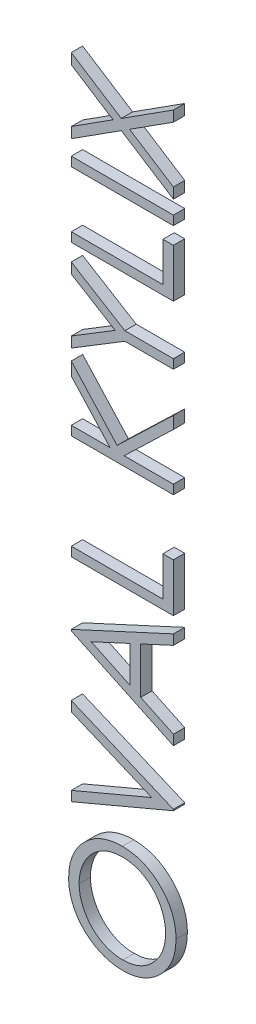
from build123d import *

# Parameters (mm, degrees)
ESTRUSIONE_ESTRUSIONE1_DEPTH   = 10
ESTRUSIONE_ESTRUSIONE1_2_DEPTH = 10
ESTRUSIONE_ESTRUSIONE1_3_DEPTH = 10
ESTRUSIONE_ESTRUSIONE1_4_DEPTH = 10
ESTRUSIONE_ESTRUSIONE1_5_DEPTH = 10
ESTRUSIONE_ESTRUSIONE1_6_DEPTH = 10
ESTRUSIONE_ESTRUSIONE1_7_DEPTH = 10
SCHIZZO2_W                     = 90
SCHIZZO2_H                     = 8.076923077
ESTRUSIONE_ESTRUSIONE1_8_DEPTH = 10
ESTRUSIONE_ESTRUSIONE1_9_DEPTH = 10


with BuildPart() as part:
    # Schizzo2 → Estrusione-Estrusione1 (new body)
    with BuildSketch(Plane.XY):
        with BuildLine():
            add(Edge.make_bspline(
                [(102.692307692, 53.653846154), (102.733806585, 55.320522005), (102.815313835, 58.594010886), (103.459836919, 63.400564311), (104.520654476, 68.003054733), (106.018755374, 72.404128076), (107.960854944, 76.587045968), (110.319949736, 80.563622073), (113.110376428, 84.32193899), (116.291160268, 87.836126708), (119.774637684, 91.04188004), (123.503766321, 93.854945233), (127.431661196, 96.228031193), (131.558527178, 98.170660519), (135.874729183, 99.69575329), (140.404457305, 100.74788327), (145.118043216, 101.420027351), (148.333021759, 101.498601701), (149.963942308, 101.538461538)],
                knots=[0, 0, 0, 0, 1.065064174, 2.09187391, 3.093564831, 4.079973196, 5.057907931, 6.036227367, 7.030399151, 8.044883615, 9.061699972, 10.052012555, 11.025713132, 11.989727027, 12.962874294, 13.945865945, 14.957962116, 16, 16, 16, 16], degree=3))
            add(Edge.make_bspline(
                [(149.963942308, 101.538461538), (151.582839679, 101.498588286), (154.773873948, 101.419993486), (159.457682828, 100.747337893), (163.959573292, 99.691058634), (168.269511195, 98.189543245), (172.387995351, 96.245423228), (176.318863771, 93.86884373), (180.057952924, 91.061117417), (183.565428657, 87.868977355), (186.773956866, 84.378863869), (189.60400372, 80.664067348), (191.978122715, 76.736277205), (193.94243974, 72.636196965), (195.435749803, 68.331631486), (196.522928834, 63.853905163), (197.188400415, 59.178621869), (197.267492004, 55.993777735), (197.307692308, 54.375)],
                knots=[0, 0, 0, 0, 1.043748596, 2.057349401, 3.045489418, 4.02252776, 4.995289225, 5.97782527, 6.980224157, 8.006516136, 9.032559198, 10.034193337, 11.013412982, 11.987833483, 12.961212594, 13.946489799, 14.956251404, 16, 16, 16, 16], degree=3))
            add(Edge.make_bspline(
                [(197.307692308, 54.375), (197.267850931, 52.744088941), (197.189312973, 49.529129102), (196.51607685, 44.809605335), (195.463300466, 40.276749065), (193.958772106, 35.943522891), (192.014329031, 31.807510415), (189.643359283, 27.860622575), (186.830032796, 24.118701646), (183.637178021, 20.612771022), (180.161338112, 17.404934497), (176.437028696, 14.608264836), (172.537316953, 12.236761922), (168.451380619, 10.298847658), (164.198972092, 8.764618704), (159.751725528, 7.71792338), (155.134995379, 7.040713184), (151.991606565, 6.962674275), (150.396634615, 6.923076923)],
                knots=[0, 0, 0, 0, 1.053102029, 2.075944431, 3.073151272, 4.055350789, 5.033113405, 6.020478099, 7.024410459, 8.052272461, 9.079885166, 10.07527673, 11.055994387, 12.023226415, 12.992069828, 13.970394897, 14.97016774, 16, 16, 16, 16], degree=3))
            add(Edge.make_bspline(
                [(150.396634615, 6.923076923), (149.326080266, 6.936824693), (147.19847709, 6.964146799), (144.039050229, 7.293076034), (140.930433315, 7.770376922), (137.881466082, 8.454426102), (134.899612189, 9.349068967), (131.964306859, 10.404692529), (129.10529682, 11.694002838), (126.309038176, 13.151505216), (123.619120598, 14.778237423), (121.076502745, 16.575042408), (118.659848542, 18.478809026), (116.431782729, 20.56586772), (114.327488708, 22.767433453), (112.379304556, 25.119220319), (110.56966296, 27.606878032), (108.938854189, 30.241110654), (107.463905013, 32.957009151), (106.198200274, 35.756697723), (105.111872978, 38.602152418), (104.231394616, 41.506700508), (103.536285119, 44.462628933), (103.062953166, 47.476389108), (102.733184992, 50.545580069), (102.705992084, 52.613299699), (102.692307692, 53.653846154)],
                knots=[0, 0, 0, 0, 1.037015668, 2.060948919, 3.074880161, 4.083647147, 5.086022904, 6.090072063, 7.104153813, 8.122640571, 9.144368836, 10.147691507, 11.138137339, 12.123020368, 13.103399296, 14.087645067, 15.080126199, 16.082011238, 17.087798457, 18.072939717, 19.057185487, 20.037253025, 21.01195951, 21.997135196, 22.992090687, 24, 24, 24, 24], degree=3))
        make_face()
        with BuildLine():
            add(Edge.make_bspline(
                [(111.923076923, 54.050480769), (111.933452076, 53.19637927), (111.954103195, 51.496341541), (112.227615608, 48.969186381), (112.614648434, 46.474500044), (113.176755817, 44.017110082), (113.903817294, 41.591862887), (114.780710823, 39.197681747), (115.840568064, 36.842775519), (117.032506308, 34.530086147), (118.386357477, 32.313029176), (119.824015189, 30.186265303), (121.398896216, 28.205113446), (123.07694135, 26.342358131), (124.872713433, 24.602631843), (126.774419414, 22.98670196), (128.790284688, 21.495893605), (130.912013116, 20.148148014), (133.127758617, 18.948759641), (135.395165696, 17.874896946), (137.740881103, 16.984705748), (140.150266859, 16.279541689), (142.612705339, 15.681018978), (145.141612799, 15.305581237), (147.728271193, 15.029373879), (149.476385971, 15.00986668), (150.360576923, 15)],
                knots=[0, 0, 0, 0, 1.008406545, 2.007172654, 2.999155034, 3.989332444, 4.982025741, 5.988181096, 6.998684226, 8.030553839, 9.059268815, 10.065399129, 11.060956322, 12.046057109, 13.024974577, 14.012068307, 14.991706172, 15.984221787, 16.978487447, 17.966117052, 18.945677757, 19.938371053, 20.93015022, 21.936155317, 22.956113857, 24, 24, 24, 24], degree=3))
            add(Edge.make_bspline(
                [(150.360576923, 15), (151.660718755, 15.032857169), (154.21849995, 15.097497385), (157.967245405, 15.661050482), (161.573456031, 16.536022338), (165.015637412, 17.804566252), (168.309139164, 19.422844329), (171.441144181, 21.396815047), (174.41072855, 23.744555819), (177.195786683, 26.409814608), (179.736807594, 29.324204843), (181.970378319, 32.417375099), (183.85021374, 35.664853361), (185.421713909, 39.047922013), (186.605616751, 42.595465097), (187.44973893, 46.284737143), (187.996838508, 50.115819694), (188.049974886, 52.726480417), (188.076923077, 54.050480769)],
                knots=[0, 0, 0, 0, 1.032022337, 2.030307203, 3.003823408, 3.974715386, 4.937372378, 5.913284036, 6.909147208, 7.938749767, 8.970518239, 9.975863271, 10.963918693, 11.946286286, 12.933361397, 13.927862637, 14.949112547, 16, 16, 16, 16], degree=3))
            add(Edge.make_bspline(
                [(188.076923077, 54.050480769), (188.064705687, 54.940442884), (188.040474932, 56.705505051), (187.79607868, 59.330767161), (187.404944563, 61.90897664), (186.8390103, 64.435369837), (186.140087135, 66.913256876), (185.273144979, 69.335161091), (184.233889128, 71.700278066), (183.075672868, 74.020237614), (181.759970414, 76.24309359), (180.34169365, 78.356956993), (178.794600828, 80.334695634), (177.139092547, 82.19657697), (175.348840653, 83.92411072), (173.45869204, 85.535439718), (171.438548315, 87.00047158), (169.325509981, 88.343648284), (167.125918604, 89.557671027), (164.852277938, 90.600471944), (162.516782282, 91.491045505), (160.117715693, 92.208948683), (157.660474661, 92.771787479), (155.141542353, 93.159537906), (152.566019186, 93.430788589), (150.82403394, 93.451232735), (149.945913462, 93.461538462)],
                knots=[0, 0, 0, 0, 1.047334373, 2.07717862, 3.100662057, 4.115010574, 5.122652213, 6.129548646, 7.140165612, 8.16200981, 9.179904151, 10.178566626, 11.156366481, 12.133321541, 13.108841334, 14.082538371, 15.054589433, 16.043660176, 17.028268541, 18.009491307, 18.985652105, 19.968123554, 20.954864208, 21.950389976, 22.966808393, 24, 24, 24, 24], degree=3))
            add(Edge.make_bspline(
                [(149.945913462, 93.461538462), (149.073800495, 93.451224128), (147.343803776, 93.430763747), (144.786239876, 93.159671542), (142.285443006, 92.771362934), (139.85123094, 92.211750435), (137.482983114, 91.490460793), (135.18292403, 90.6010722), (132.942484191, 89.552307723), (130.767204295, 88.348666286), (128.679846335, 86.995693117), (126.684383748, 85.517250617), (124.818122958, 83.887927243), (123.035621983, 82.153848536), (121.372534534, 80.273323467), (119.835286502, 78.246023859), (118.35461462, 76.122426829), (117.044203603, 73.854508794), (115.827982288, 71.522331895), (114.790358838, 69.127055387), (113.899187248, 66.702887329), (113.174585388, 64.240135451), (112.616801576, 61.739963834), (112.227269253, 59.203826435), (111.954197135, 56.640575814), (111.933483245, 54.916585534), (111.923076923, 54.050480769)],
                knots=[0, 0, 0, 0, 1.029877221, 2.042951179, 3.035109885, 4.018542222, 4.991021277, 5.957494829, 6.929429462, 7.911425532, 8.892163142, 9.866273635, 10.842761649, 11.81676864, 12.802607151, 13.805177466, 14.821356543, 15.858816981, 16.897175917, 17.927346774, 18.940346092, 19.946830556, 20.957962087, 21.964146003, 22.97721996, 24, 24, 24, 24], degree=3))
        make_face(mode=Mode.SUBTRACT)
    extrude(amount=ESTRUSIONE_ESTRUSIONE1_DEPTH)


with BuildPart() as body_2:
    # Schizzo2 → Estrusione-Estrusione1 2 (new body)
    with BuildSketch(Plane.XY):
        Polygon((105, 113.076923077), (105, 121.730769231), (175.925480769, 151.730769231), (105, 181.730769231), (105, 190.384615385), (195, 152.307692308), (195, 151.153846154), align=None)
    extrude(amount=ESTRUSIONE_ESTRUSIONE1_2_DEPTH)


with BuildPart() as body_3:
    # Schizzo2 → Estrusione-Estrusione1 3 (new body)
    with BuildSketch(Plane.XY):
        Polygon((105, 244.615384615), (195, 286.153846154), (195, 277.373798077), (166.153846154, 264.068509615), (166.153846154, 223.269230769), (195, 209.585336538), (195, 200.769230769), (105, 243.461538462), align=None)
        Polygon((122.542067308, 243.948317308), (156.923076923, 227.650240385), (156.923076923, 259.813701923), align=None, mode=Mode.SUBTRACT)
    extrude(amount=ESTRUSIONE_ESTRUSIONE1_3_DEPTH)


with BuildPart() as body_4:
    # Schizzo2 → Estrusione-Estrusione1 4 (new body)
    with BuildSketch(Plane.XY):
        Polygon((105, 300), (105, 308.076923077), (185.769230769, 308.076923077), (185.769230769, 342.692307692), (195, 342.692307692), (195, 300), align=None)
    extrude(amount=ESTRUSIONE_ESTRUSIONE1_4_DEPTH)


with BuildPart() as body_5:
    # Schizzo2 → Estrusione-Estrusione1 5 (new body)
    with BuildSketch(Plane.XY):
        Polygon((105, 392.307692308), (105, 400.384615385), (139.272836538, 400.384615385), (105, 437.902644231), (105, 449.423076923), (145.384615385, 405.198317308), (195, 452.884615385), (195, 442.121394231), (151.568509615, 400.384615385), (195, 400.384615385), (195, 392.307692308), align=None)
    extrude(amount=ESTRUSIONE_ESTRUSIONE1_5_DEPTH)


with BuildPart() as body_6:
    # Schizzo2 → Estrusione-Estrusione1 6 (new body)
    with BuildSketch(Plane.XY):
        Polygon((105, 459.230769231), (105, 468.479567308), (143.671875, 492.133413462), (105, 515.751201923), (105, 525), (152.217548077, 496.153846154), (195, 496.153846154), (195, 488.076923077), (152.217548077, 488.076923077), align=None)
    extrude(amount=ESTRUSIONE_ESTRUSIONE1_6_DEPTH)


with BuildPart() as body_7:
    # Schizzo2 → Estrusione-Estrusione1 7 (new body)
    with BuildSketch(Plane.XY):
        Polygon((105, 540), (105, 548.076923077), (185.769230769, 548.076923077), (185.769230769, 582.692307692), (195, 582.692307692), (195, 540), align=None)
    extrude(amount=ESTRUSIONE_ESTRUSIONE1_7_DEPTH)


with BuildPart() as body_8:
    # Schizzo2 → Estrusione-Estrusione1 8 (new body)
    with BuildSketch(Plane.XY):
        with Locations((150, 601.730769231)):
            Rectangle(SCHIZZO2_W, SCHIZZO2_H)
    extrude(amount=ESTRUSIONE_ESTRUSIONE1_8_DEPTH)


with BuildPart() as body_9:
    # Schizzo2 → Estrusione-Estrusione1 9 (new body)
    with BuildSketch(Plane.XY):
        Polygon((105, 619.038461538), (105, 628.359375), (141.814903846, 651.923076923), (105, 675.486778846), (105, 684.807692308), (149.098557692, 656.592548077), (195, 685.961538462), (195, 676.640625), (156.382211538, 651.923076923), (195, 627.205528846), (195, 617.884615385), (149.098557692, 647.271634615), align=None)
    extrude(amount=ESTRUSIONE_ESTRUSIONE1_9_DEPTH)


solid = Compound([part.part, body_2.part, body_3.part, body_4.part, body_5.part, body_6.part, body_7.part, body_8.part, body_9.part])
